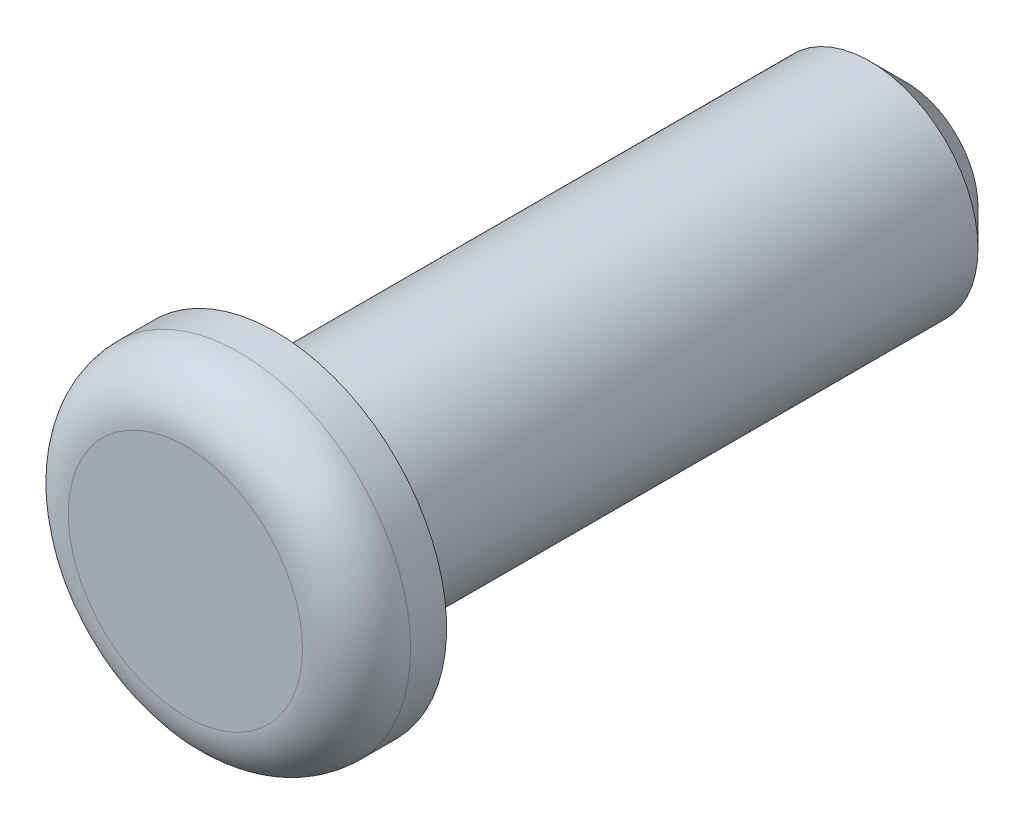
ISO-10303-21;
HEADER;
FILE_DESCRIPTION(('STEP AP214'),'2;1');
FILE_NAME('part.step','',(''),(''),'','','');
FILE_SCHEMA(('AUTOMOTIVE_DESIGN { 1 0 10303 214 1 1 1 1 }'));
ENDSEC;
DATA;
#1=APPLICATION_CONTEXT('core data for automotive mechanical design processes');
#2=APPLICATION_PROTOCOL_DEFINITION('international standard','automotive_design',2000,#1);
#3=PRODUCT_CONTEXT('',#1,'mechanical');
#4=PRODUCT('Part','Part','',(#3));
#5=PRODUCT_RELATED_PRODUCT_CATEGORY('part','',(#4));
#6=PRODUCT_DEFINITION_FORMATION('','',#4);
#7=PRODUCT_DEFINITION_CONTEXT('part definition',#1,'design');
#8=PRODUCT_DEFINITION('design','',#6,#7);
#9=PRODUCT_DEFINITION_SHAPE('','',#8);
#10=(LENGTH_UNIT() NAMED_UNIT(*) SI_UNIT(.MILLI.,.METRE.));
#11=(NAMED_UNIT(*) PLANE_ANGLE_UNIT() SI_UNIT($,.RADIAN.));
#12=(NAMED_UNIT(*) SI_UNIT($,.STERADIAN.) SOLID_ANGLE_UNIT());
#13=UNCERTAINTY_MEASURE_WITH_UNIT(LENGTH_MEASURE(1.E-05),#10,'distance_accuracy_value','');
#14=(GEOMETRIC_REPRESENTATION_CONTEXT(3) GLOBAL_UNCERTAINTY_ASSIGNED_CONTEXT((#13)) GLOBAL_UNIT_ASSIGNED_CONTEXT((#10,
#11,#12)) REPRESENTATION_CONTEXT('',''));
#15=CARTESIAN_POINT('',(0.,0.,0.));
#16=DIRECTION('',(0.,0.,1.));
#17=DIRECTION('',(1.,0.,0.));
#18=AXIS2_PLACEMENT_3D('',#15,#16,#17);
#19=CARTESIAN_POINT('',(0.,0.,0.5));
#20=DIRECTION('',(0.,0.,1.));
#21=DIRECTION('',(1.,0.,0.));
#22=AXIS2_PLACEMENT_3D('',#19,#20,#21);
#23=PLANE('',#22);
#24=CARTESIAN_POINT('',(0.,0.,0.5));
#25=DIRECTION('',(0.,0.,-1.));
#26=DIRECTION('',(1.,0.,0.));
#27=AXIS2_PLACEMENT_3D('',#24,#25,#26);
#28=CIRCLE('',#27,0.65);
#29=CARTESIAN_POINT('',(0.65,0.,0.5));
#30=VERTEX_POINT('',#29);
#31=EDGE_CURVE('E42',#30,#30,#28,.T.);
#32=ORIENTED_EDGE('',*,*,#31,.F.);
#33=EDGE_LOOP('',(#32));
#34=FACE_BOUND('',#33,.T.);
#35=ADVANCED_FACE('F15',(#34),#23,.T.);
#36=CARTESIAN_POINT('',(0.,0.,0.2));
#37=DIRECTION('',(0.,0.,1.));
#38=DIRECTION('',(1.,0.,0.));
#39=AXIS2_PLACEMENT_3D('',#36,#37,#38);
#40=TOROIDAL_SURFACE('',#39,0.65,0.3);
#41=ORIENTED_EDGE('',*,*,#31,.T.);
#42=EDGE_LOOP('',(#41));
#43=FACE_BOUND('',#42,.T.);
#44=CARTESIAN_POINT('',(0.,0.,0.2));
#45=DIRECTION('',(0.,0.,-1.));
#46=DIRECTION('',(-1.,0.,0.));
#47=AXIS2_PLACEMENT_3D('',#44,#45,#46);
#48=CIRCLE('',#47,0.95);
#49=CARTESIAN_POINT('',(-0.95,0.,0.2));
#50=VERTEX_POINT('',#49);
#51=EDGE_CURVE('E38',#50,#50,#48,.T.);
#52=ORIENTED_EDGE('',*,*,#51,.F.);
#53=EDGE_LOOP('',(#52));
#54=FACE_BOUND('',#53,.T.);
#55=ADVANCED_FACE('F56',(#43,#54),#40,.T.);
#56=CARTESIAN_POINT('',(0.,0.,-3.5));
#57=DIRECTION('',(0.,0.,1.));
#58=DIRECTION('',(1.,0.,0.));
#59=AXIS2_PLACEMENT_3D('',#56,#57,#58);
#60=PLANE('',#59);
#61=CARTESIAN_POINT('',(0.,0.,-3.50000000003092));
#62=DIRECTION('',(0.,0.,1.));
#63=DIRECTION('',(1.,0.,0.));
#64=AXIS2_PLACEMENT_3D('',#61,#62,#63);
#65=CIRCLE('',#64,0.400000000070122);
#66=CARTESIAN_POINT('',(0.400000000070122,0.,-3.50000000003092));
#67=VERTEX_POINT('',#66);
#68=EDGE_CURVE('E19',#67,#67,#65,.T.);
#69=ORIENTED_EDGE('',*,*,#68,.F.);
#70=EDGE_LOOP('',(#69));
#71=FACE_BOUND('',#70,.T.);
#72=ADVANCED_FACE('F60',(#71),#60,.F.);
#73=CARTESIAN_POINT('',(0.,0.,0.5));
#74=DIRECTION('',(0.,0.,-1.));
#75=DIRECTION('',(-1.,0.,0.));
#76=AXIS2_PLACEMENT_3D('',#73,#74,#75);
#77=CYLINDRICAL_SURFACE('',#76,0.95);
#78=CARTESIAN_POINT('',(0.,0.,0.));
#79=DIRECTION('',(0.,0.,-1.));
#80=DIRECTION('',(-1.,0.,0.));
#81=AXIS2_PLACEMENT_3D('',#78,#79,#80);
#82=CIRCLE('',#81,0.95);
#83=CARTESIAN_POINT('',(-0.95,0.,0.));
#84=VERTEX_POINT('',#83);
#85=EDGE_CURVE('E28',#84,#84,#82,.F.);
#86=ORIENTED_EDGE('',*,*,#85,.T.);
#87=EDGE_LOOP('',(#86));
#88=FACE_BOUND('',#87,.T.);
#89=ORIENTED_EDGE('',*,*,#51,.T.);
#90=EDGE_LOOP('',(#89));
#91=FACE_BOUND('',#90,.T.);
#92=ADVANCED_FACE('F64',(#88,#91),#77,.T.);
#93=CARTESIAN_POINT('',(0.,0.,-3.30000000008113));
#94=DIRECTION('',(0.,0.,1.));
#95=DIRECTION('',(1.,0.,0.));
#96=AXIS2_PLACEMENT_3D('',#93,#94,#95);
#97=CONICAL_SURFACE('',#96,0.600000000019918,0.785398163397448);
#98=CARTESIAN_POINT('',(0.,0.,-3.3));
#99=DIRECTION('',(0.,0.,1.));
#100=DIRECTION('',(1.,0.,0.));
#101=AXIS2_PLACEMENT_3D('',#98,#99,#100);
#102=CIRCLE('',#101,0.6);
#103=CARTESIAN_POINT('',(0.6,0.,-3.3));
#104=VERTEX_POINT('',#103);
#105=EDGE_CURVE('E23',#104,#104,#102,.T.);
#106=ORIENTED_EDGE('',*,*,#105,.F.);
#107=EDGE_LOOP('',(#106));
#108=FACE_BOUND('',#107,.T.);
#109=ORIENTED_EDGE('',*,*,#68,.T.);
#110=EDGE_LOOP('',(#109));
#111=FACE_BOUND('',#110,.T.);
#112=ADVANCED_FACE('F68',(#108,#111),#97,.T.);
#113=CARTESIAN_POINT('',(0.,0.,0.));
#114=DIRECTION('',(0.,0.,1.));
#115=DIRECTION('',(1.,0.,0.));
#116=AXIS2_PLACEMENT_3D('',#113,#114,#115);
#117=PLANE('',#116);
#118=ORIENTED_EDGE('',*,*,#85,.F.);
#119=EDGE_LOOP('',(#118));
#120=FACE_BOUND('',#119,.T.);
#121=CARTESIAN_POINT('',(0.,0.,0.));
#122=DIRECTION('',(0.,0.,1.));
#123=DIRECTION('',(1.,0.,0.));
#124=AXIS2_PLACEMENT_3D('',#121,#122,#123);
#125=CIRCLE('',#124,0.6);
#126=CARTESIAN_POINT('',(0.6,0.,0.));
#127=VERTEX_POINT('',#126);
#128=EDGE_CURVE('E10',#127,#127,#125,.F.);
#129=ORIENTED_EDGE('',*,*,#128,.F.);
#130=EDGE_LOOP('',(#129));
#131=FACE_BOUND('',#130,.T.);
#132=ADVANCED_FACE('F71',(#120,#131),#117,.F.);
#133=CARTESIAN_POINT('',(0.,0.,-3.5));
#134=DIRECTION('',(0.,0.,1.));
#135=DIRECTION('',(1.,0.,0.));
#136=AXIS2_PLACEMENT_3D('',#133,#134,#135);
#137=CYLINDRICAL_SURFACE('',#136,0.6);
#138=ORIENTED_EDGE('',*,*,#128,.T.);
#139=EDGE_LOOP('',(#138));
#140=FACE_BOUND('',#139,.T.);
#141=ORIENTED_EDGE('',*,*,#105,.T.);
#142=EDGE_LOOP('',(#141));
#143=FACE_BOUND('',#142,.T.);
#144=ADVANCED_FACE('F75',(#140,#143),#137,.T.);
#145=CLOSED_SHELL('',(#35,#55,#72,#92,#112,#132,#144));
#146=MANIFOLD_SOLID_BREP('B1',#145);
#147=ADVANCED_BREP_SHAPE_REPRESENTATION('',(#18,#146),#14);
#148=SHAPE_DEFINITION_REPRESENTATION(#9,#147);
ENDSEC;
END-ISO-10303-21;
